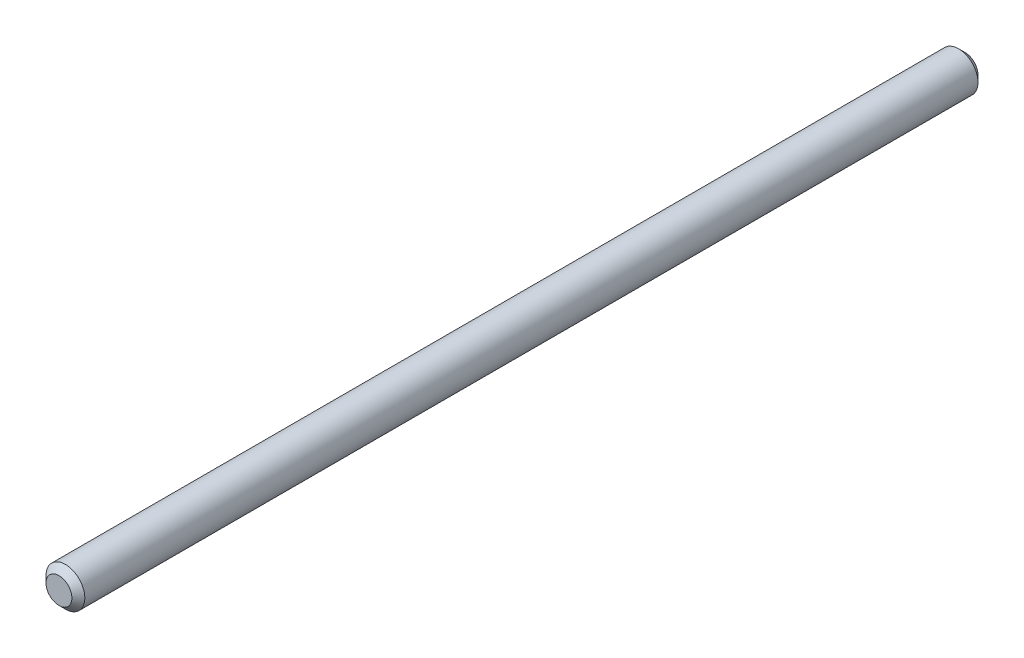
from build123d import *

# Parameters (mm, degrees)
ESQUISSE1_R          = 1.5
BASE_EXTRUSION_DEPTH = 70
CHANFREIN1_SIZE      = 0.5


with BuildPart() as part:
    # Esquisse1 → Base-Extrusion (new body)
    with BuildSketch(Plane.XY):
        Circle(ESQUISSE1_R)
    extrude(amount=BASE_EXTRUSION_DEPTH)

    # Chanfrein1
    chanfrein1_edges = [part.edges().sort_by_distance(p)[0] for p in [
        (-1.5, 0, 0),
        (-1.5, 0, 70),
    ]]
    chamfer(chanfrein1_edges, length=CHANFREIN1_SIZE)


solid = part.part
